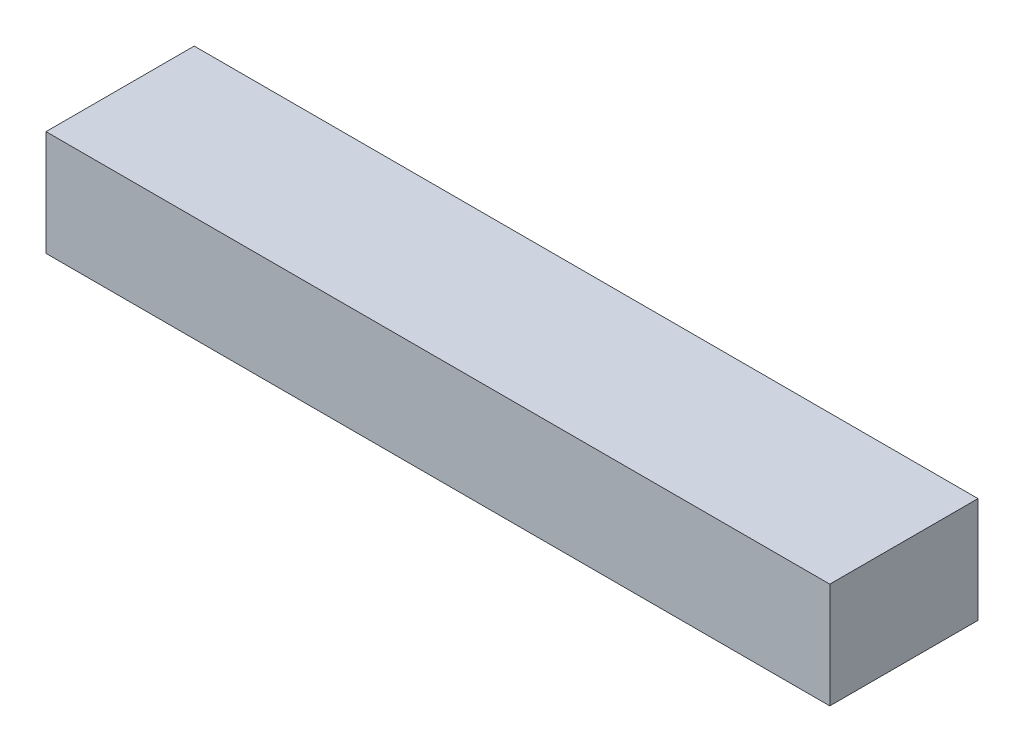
ISO-10303-21;
HEADER;
FILE_DESCRIPTION(('STEP AP214'),'2;1');
FILE_NAME('part.step','',(''),(''),'','','');
FILE_SCHEMA(('AUTOMOTIVE_DESIGN { 1 0 10303 214 1 1 1 1 }'));
ENDSEC;
DATA;
#1=APPLICATION_CONTEXT('core data for automotive mechanical design processes');
#2=APPLICATION_PROTOCOL_DEFINITION('international standard','automotive_design',2000,#1);
#3=PRODUCT_CONTEXT('',#1,'mechanical');
#4=PRODUCT('Part','Part','',(#3));
#5=PRODUCT_RELATED_PRODUCT_CATEGORY('part','',(#4));
#6=PRODUCT_DEFINITION_FORMATION('','',#4);
#7=PRODUCT_DEFINITION_CONTEXT('part definition',#1,'design');
#8=PRODUCT_DEFINITION('design','',#6,#7);
#9=PRODUCT_DEFINITION_SHAPE('','',#8);
#10=(LENGTH_UNIT() NAMED_UNIT(*) SI_UNIT(.MILLI.,.METRE.));
#11=(NAMED_UNIT(*) PLANE_ANGLE_UNIT() SI_UNIT($,.RADIAN.));
#12=(NAMED_UNIT(*) SI_UNIT($,.STERADIAN.) SOLID_ANGLE_UNIT());
#13=UNCERTAINTY_MEASURE_WITH_UNIT(LENGTH_MEASURE(1.E-05),#10,'distance_accuracy_value','');
#14=(GEOMETRIC_REPRESENTATION_CONTEXT(3) GLOBAL_UNCERTAINTY_ASSIGNED_CONTEXT((#13)) GLOBAL_UNIT_ASSIGNED_CONTEXT((#10,
#11,#12)) REPRESENTATION_CONTEXT('',''));
#15=CARTESIAN_POINT('',(0.,0.,0.));
#16=DIRECTION('',(0.,0.,1.));
#17=DIRECTION('',(1.,0.,0.));
#18=AXIS2_PLACEMENT_3D('',#15,#16,#17);
#19=CARTESIAN_POINT('',(-185.107266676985,-24.9115384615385,35.));
#20=DIRECTION('',(1.,0.,0.));
#21=DIRECTION('',(0.,0.,-1.));
#22=AXIS2_PLACEMENT_3D('',#19,#20,#21);
#23=PLANE('',#22);
#24=DIRECTION('',(0.,-1.,0.));
#25=VECTOR('',#24,1.);
#26=CARTESIAN_POINT('',(-185.107266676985,-24.9115384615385,-35.));
#27=LINE('',#26,#25);
#28=CARTESIAN_POINT('',(-185.107266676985,24.9115384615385,-35.));
#29=VERTEX_POINT('',#28);
#30=CARTESIAN_POINT('',(-185.107266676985,-24.9115384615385,-35.));
#31=VERTEX_POINT('',#30);
#32=EDGE_CURVE('E105',#29,#31,#27,.T.);
#33=ORIENTED_EDGE('',*,*,#32,.T.);
#34=DIRECTION('',(0.,0.,-1.));
#35=VECTOR('',#34,1.);
#36=CARTESIAN_POINT('',(-185.107266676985,-24.9115384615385,35.));
#37=LINE('',#36,#35);
#38=CARTESIAN_POINT('',(-185.107266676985,-24.9115384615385,35.));
#39=VERTEX_POINT('',#38);
#40=EDGE_CURVE('E11',#39,#31,#37,.T.);
#41=ORIENTED_EDGE('',*,*,#40,.F.);
#42=DIRECTION('',(0.,-1.,0.));
#43=VECTOR('',#42,1.);
#44=CARTESIAN_POINT('',(-185.107266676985,-24.9115384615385,35.));
#45=LINE('',#44,#43);
#46=CARTESIAN_POINT('',(-185.107266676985,24.9115384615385,35.));
#47=VERTEX_POINT('',#46);
#48=EDGE_CURVE('E93',#47,#39,#45,.T.);
#49=ORIENTED_EDGE('',*,*,#48,.F.);
#50=DIRECTION('',(0.,0.,-1.));
#51=VECTOR('',#50,1.);
#52=CARTESIAN_POINT('',(-185.107266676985,24.9115384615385,35.));
#53=LINE('',#52,#51);
#54=EDGE_CURVE('E101',#47,#29,#53,.T.);
#55=ORIENTED_EDGE('',*,*,#54,.T.);
#56=EDGE_LOOP('',(#33,#41,#49,#55));
#57=FACE_BOUND('',#56,.T.);
#58=ADVANCED_FACE('F38',(#57),#23,.F.);
#59=CARTESIAN_POINT('',(185.107266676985,-24.9115384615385,35.));
#60=DIRECTION('',(0.,1.,0.));
#61=DIRECTION('',(0.,0.,1.));
#62=AXIS2_PLACEMENT_3D('',#59,#60,#61);
#63=PLANE('',#62);
#64=DIRECTION('',(1.,0.,0.));
#65=VECTOR('',#64,1.);
#66=CARTESIAN_POINT('',(185.107266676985,-24.9115384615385,-35.));
#67=LINE('',#66,#65);
#68=CARTESIAN_POINT('',(185.107266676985,-24.9115384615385,-35.));
#69=VERTEX_POINT('',#68);
#70=EDGE_CURVE('E97',#31,#69,#67,.T.);
#71=ORIENTED_EDGE('',*,*,#70,.T.);
#72=DIRECTION('',(0.,0.,-1.));
#73=VECTOR('',#72,1.);
#74=CARTESIAN_POINT('',(185.107266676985,-24.9115384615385,35.));
#75=LINE('',#74,#73);
#76=CARTESIAN_POINT('',(185.107266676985,-24.9115384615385,35.));
#77=VERTEX_POINT('',#76);
#78=EDGE_CURVE('E46',#77,#69,#75,.T.);
#79=ORIENTED_EDGE('',*,*,#78,.F.);
#80=DIRECTION('',(1.,0.,0.));
#81=VECTOR('',#80,1.);
#82=CARTESIAN_POINT('',(185.107266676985,-24.9115384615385,35.));
#83=LINE('',#82,#81);
#84=EDGE_CURVE('E84',#39,#77,#83,.T.);
#85=ORIENTED_EDGE('',*,*,#84,.F.);
#86=ORIENTED_EDGE('',*,*,#40,.T.);
#87=EDGE_LOOP('',(#71,#79,#85,#86));
#88=FACE_BOUND('',#87,.T.);
#89=ADVANCED_FACE('F96',(#88),#63,.F.);
#90=CARTESIAN_POINT('',(185.107266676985,-24.9115384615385,35.));
#91=DIRECTION('',(-1.,0.,0.));
#92=DIRECTION('',(0.,0.,1.));
#93=AXIS2_PLACEMENT_3D('',#90,#91,#92);
#94=PLANE('',#93);
#95=DIRECTION('',(0.,1.,0.));
#96=VECTOR('',#95,1.);
#97=CARTESIAN_POINT('',(185.107266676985,-24.9115384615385,-35.));
#98=LINE('',#97,#96);
#99=CARTESIAN_POINT('',(185.107266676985,24.9115384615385,-35.));
#100=VERTEX_POINT('',#99);
#101=EDGE_CURVE('E71',#69,#100,#98,.T.);
#102=ORIENTED_EDGE('',*,*,#101,.T.);
#103=DIRECTION('',(0.,0.,-1.));
#104=VECTOR('',#103,1.);
#105=CARTESIAN_POINT('',(185.107266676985,24.9115384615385,35.));
#106=LINE('',#105,#104);
#107=CARTESIAN_POINT('',(185.107266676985,24.9115384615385,35.));
#108=VERTEX_POINT('',#107);
#109=EDGE_CURVE('E98',#108,#100,#106,.T.);
#110=ORIENTED_EDGE('',*,*,#109,.F.);
#111=DIRECTION('',(0.,1.,0.));
#112=VECTOR('',#111,1.);
#113=CARTESIAN_POINT('',(185.107266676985,-24.9115384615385,35.));
#114=LINE('',#113,#112);
#115=EDGE_CURVE('E91',#77,#108,#114,.T.);
#116=ORIENTED_EDGE('',*,*,#115,.F.);
#117=ORIENTED_EDGE('',*,*,#78,.T.);
#118=EDGE_LOOP('',(#102,#110,#116,#117));
#119=FACE_BOUND('',#118,.T.);
#120=ADVANCED_FACE('F99',(#119),#94,.F.);
#121=CARTESIAN_POINT('',(185.107266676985,24.9115384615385,35.));
#122=DIRECTION('',(0.,-1.,0.));
#123=DIRECTION('',(0.,0.,-1.));
#124=AXIS2_PLACEMENT_3D('',#121,#122,#123);
#125=PLANE('',#124);
#126=DIRECTION('',(-1.,0.,0.));
#127=VECTOR('',#126,1.);
#128=CARTESIAN_POINT('',(185.107266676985,24.9115384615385,-35.));
#129=LINE('',#128,#127);
#130=EDGE_CURVE('E77',#100,#29,#129,.T.);
#131=ORIENTED_EDGE('',*,*,#130,.T.);
#132=ORIENTED_EDGE('',*,*,#54,.F.);
#133=DIRECTION('',(-1.,0.,0.));
#134=VECTOR('',#133,1.);
#135=CARTESIAN_POINT('',(185.107266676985,24.9115384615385,35.));
#136=LINE('',#135,#134);
#137=EDGE_CURVE('E54',#108,#47,#136,.T.);
#138=ORIENTED_EDGE('',*,*,#137,.F.);
#139=ORIENTED_EDGE('',*,*,#109,.T.);
#140=EDGE_LOOP('',(#131,#132,#138,#139));
#141=FACE_BOUND('',#140,.T.);
#142=ADVANCED_FACE('F112',(#141),#125,.F.);
#143=CARTESIAN_POINT('',(0.,0.,35.));
#144=DIRECTION('',(0.,0.,1.));
#145=DIRECTION('',(1.,0.,0.));
#146=AXIS2_PLACEMENT_3D('',#143,#144,#145);
#147=PLANE('',#146);
#148=ORIENTED_EDGE('',*,*,#48,.T.);
#149=ORIENTED_EDGE('',*,*,#84,.T.);
#150=ORIENTED_EDGE('',*,*,#115,.T.);
#151=ORIENTED_EDGE('',*,*,#137,.T.);
#152=EDGE_LOOP('',(#148,#149,#150,#151));
#153=FACE_BOUND('',#152,.T.);
#154=ADVANCED_FACE('F89',(#153),#147,.T.);
#155=CARTESIAN_POINT('',(0.,0.,-35.));
#156=DIRECTION('',(0.,0.,1.));
#157=DIRECTION('',(1.,0.,0.));
#158=AXIS2_PLACEMENT_3D('',#155,#156,#157);
#159=PLANE('',#158);
#160=ORIENTED_EDGE('',*,*,#32,.F.);
#161=ORIENTED_EDGE('',*,*,#130,.F.);
#162=ORIENTED_EDGE('',*,*,#101,.F.);
#163=ORIENTED_EDGE('',*,*,#70,.F.);
#164=EDGE_LOOP('',(#160,#161,#162,#163));
#165=FACE_BOUND('',#164,.T.);
#166=ADVANCED_FACE('F115',(#165),#159,.F.);
#167=CLOSED_SHELL('',(#58,#89,#120,#142,#154,#166));
#168=MANIFOLD_SOLID_BREP('B2',#167);
#169=ADVANCED_BREP_SHAPE_REPRESENTATION('',(#18,#168),#14);
#170=SHAPE_DEFINITION_REPRESENTATION(#9,#169);
ENDSEC;
END-ISO-10303-21;
